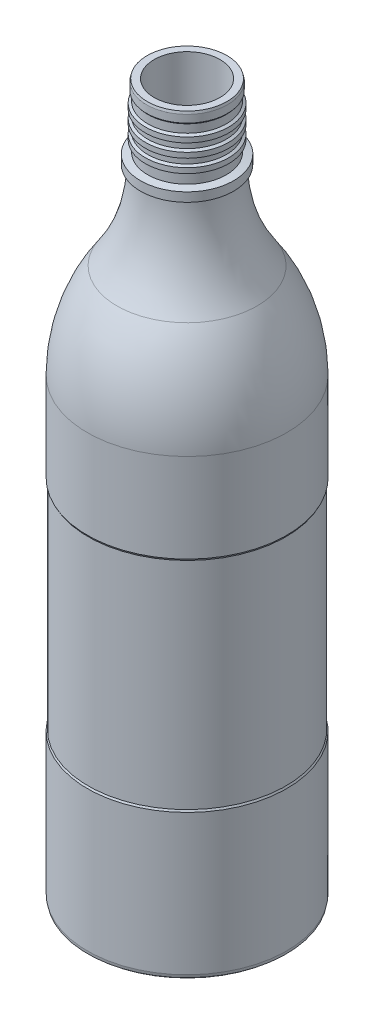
from build123d import *


with BuildPart() as part:
    # Sketch 1 → Revolve 1 (revolve)
    with BuildSketch(Plane.XY, mode=Mode.PRIVATE) as revolve_1_sk:
        with BuildLine():
            Line((0, 8), (21, 8))
            Line((21, 8), (24.5, 7.4))
            Line((24.5, 7.4), (27.5, 5))
            Line((27.5, 5), (29, 1.2))
            Line((29, 1.2), (30.5, 0))
            Line((30.5, 0), (32.2, 0))
            Line((32.2, 0), (32.8, 0.5))
            Line((32.8, 0.5), (33, 1.5))
            Line((33, 1.5), (33, 48))
            Line((33, 48), (32.7, 48.6))
            Line((32.7, 48.6), (32.7, 120))
            Line((32.7, 120), (33, 120.6))
            Line((33, 120.6), (33, 150))
            ThreePointArc((33, 150), (30.483931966, 166.444965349), (23.165931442, 181.385325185))
            ThreePointArc((23.165931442, 181.385325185), (16.493953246, 195.006772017), (14.2, 210))
            Line((14.2, 210), (15.4, 210.4))
            Line((15.4, 210.4), (15.4, 213.4))
            Line((15.4, 213.4), (13, 213.9))
            Line((13, 213.9), (13, 217))
            Line((13, 217), (13.8, 217.5))
            Line((13.8, 217.5), (13.8, 219.2))
            Line((13.8, 219.2), (13, 219.7))
            Line((13, 219.7), (13, 221.4))
            Line((13, 221.4), (13.8, 221.9))
            Line((13.8, 221.9), (13.8, 223.6))
            Line((13.8, 223.6), (13, 224.1))
            Line((13, 224.1), (13, 225.8))
            Line((13, 225.8), (13.8, 226.3))
            Line((13.8, 226.3), (13.8, 228))
            Line((13.8, 228), (13, 228.5))
            Line((13, 228.5), (13, 231.2))
            Line((13, 231.2), (13.4, 231.7))
            Line((13.4, 231.7), (13.4, 234.2))
            Line((13.4, 234.2), (13.2, 235))
            Line((13.2, 235), (10.9, 235))
            Line((10.9, 235), (10.9, 211.2))
            ThreePointArc((10.9, 211.2), (13.501956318, 196.092944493), (21.007974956, 182.726831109))
            ThreePointArc((21.007974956, 182.726831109), (29.318991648, 167.927242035), (32.2, 151.2))
            Line((32.2, 151.2), (32.2, 120))
            Line((32.2, 120), (31.9, 119.4))
            Line((31.9, 119.4), (31.9, 48.6))
            Line((31.9, 48.6), (32.2, 48))
            Line((32.2, 48), (32.2, 12))
            Line((32.2, 12), (31.5, 10.6))
            Line((31.5, 10.6), (30, 9.6))
            Line((30, 9.6), (28, 9))
            Line((28, 9), (25, 8.8))
            Line((25, 8.8), (0, 8.8))
            Line((0, 8.8), (0, 8))
        make_face()
    revolve(revolve_1_sk.sketch.rotate(Axis((0, -10, 0), (0, 1, 0)), 90), axis=Axis((0, -10, 0), (0, 1, 0)))


solid = part.part
